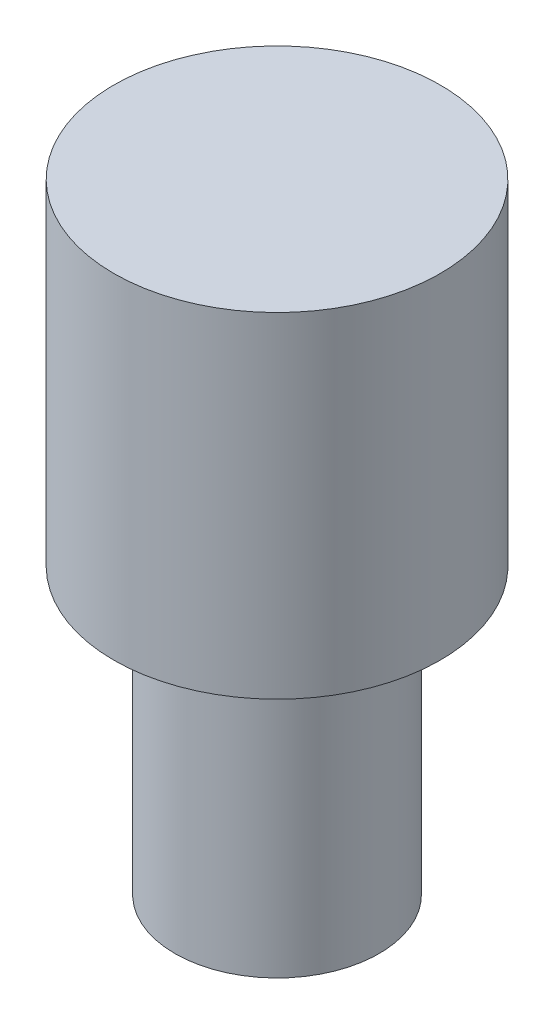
from build123d import *

# Parameters (mm, degrees)
ESQUISSE1_R      = 3.9
EXTRUSION1_DEPTH = 8
ESQUISSE2_R      = 2.44
EXTRUSION2_DEPTH = 6.8


with BuildPart() as part:
    # Esquisse1 → Extrusion1 (new body)
    with BuildSketch(Plane(origin=(0, 0, 0), x_dir=(1, 0, 0), z_dir=(0, 1, 0))):
        with Locations(Location((0, 0, 0), (0, 0, 270))):
            Circle(ESQUISSE1_R)
    extrude(amount=EXTRUSION1_DEPTH)

    # Esquisse2 → Extrusion2 (add)
    with BuildSketch(Plane.XZ):
        with Locations(Location((0, 0, 0), (0, 0, 90))):
            Circle(ESQUISSE2_R)
    extrude(amount=EXTRUSION2_DEPTH)


solid = part.part
